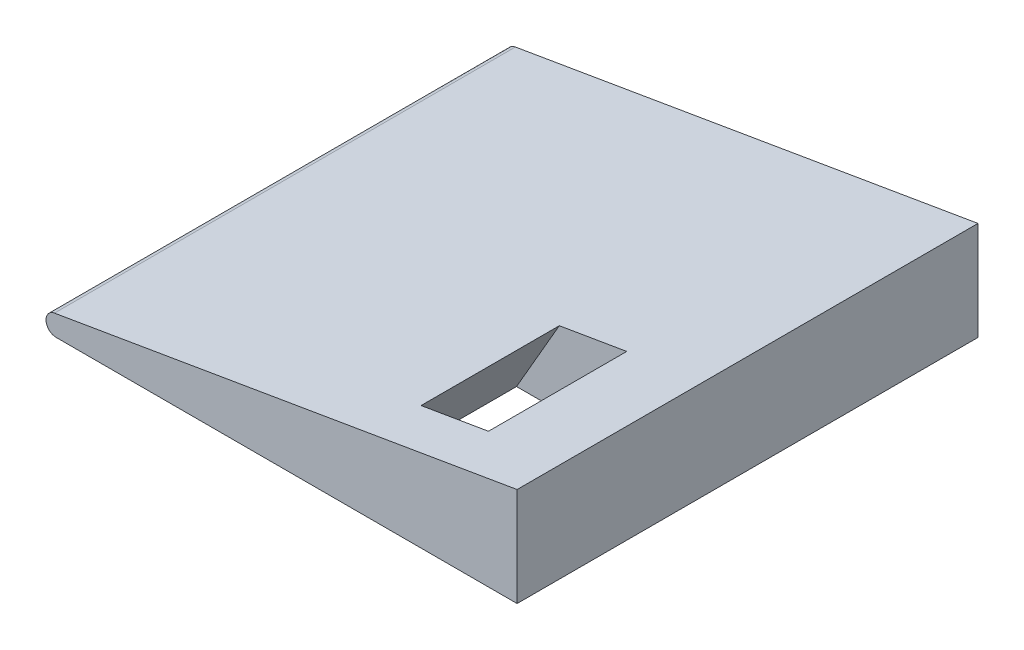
ISO-10303-21;
HEADER;
FILE_DESCRIPTION(('STEP AP214'),'2;1');
FILE_NAME('part.step','',(''),(''),'','','');
FILE_SCHEMA(('AUTOMOTIVE_DESIGN { 1 0 10303 214 1 1 1 1 }'));
ENDSEC;
DATA;
#1=APPLICATION_CONTEXT('core data for automotive mechanical design processes');
#2=APPLICATION_PROTOCOL_DEFINITION('international standard','automotive_design',2000,#1);
#3=PRODUCT_CONTEXT('',#1,'mechanical');
#4=PRODUCT('Part','Part','',(#3));
#5=PRODUCT_RELATED_PRODUCT_CATEGORY('part','',(#4));
#6=PRODUCT_DEFINITION_FORMATION('','',#4);
#7=PRODUCT_DEFINITION_CONTEXT('part definition',#1,'design');
#8=PRODUCT_DEFINITION('design','',#6,#7);
#9=PRODUCT_DEFINITION_SHAPE('','',#8);
#10=(LENGTH_UNIT() NAMED_UNIT(*) SI_UNIT(.MILLI.,.METRE.));
#11=(NAMED_UNIT(*) PLANE_ANGLE_UNIT() SI_UNIT($,.RADIAN.));
#12=(NAMED_UNIT(*) SI_UNIT($,.STERADIAN.) SOLID_ANGLE_UNIT());
#13=UNCERTAINTY_MEASURE_WITH_UNIT(LENGTH_MEASURE(1.E-05),#10,'distance_accuracy_value','');
#14=(GEOMETRIC_REPRESENTATION_CONTEXT(3) GLOBAL_UNCERTAINTY_ASSIGNED_CONTEXT((#13)) GLOBAL_UNIT_ASSIGNED_CONTEXT((#10,
#11,#12)) REPRESENTATION_CONTEXT('',''));
#15=CARTESIAN_POINT('',(0.,0.,0.));
#16=DIRECTION('',(0.,0.,1.));
#17=DIRECTION('',(1.,0.,0.));
#18=AXIS2_PLACEMENT_3D('',#15,#16,#17);
#19=CARTESIAN_POINT('',(0.,76.2,177.8));
#20=DIRECTION('',(-1.,0.,0.));
#21=DIRECTION('',(0.,-1.,0.));
#22=AXIS2_PLACEMENT_3D('',#19,#20,#21);
#23=PLANE('',#22);
#24=DIRECTION('',(0.,1.,0.));
#25=VECTOR('',#24,1.);
#26=CARTESIAN_POINT('',(0.,76.2,-177.8));
#27=LINE('',#26,#25);
#28=CARTESIAN_POINT('',(0.,0.,-177.8));
#29=VERTEX_POINT('',#28);
#30=CARTESIAN_POINT('',(0.,76.2,-177.8));
#31=VERTEX_POINT('',#30);
#32=EDGE_CURVE('E138',#29,#31,#27,.T.);
#33=ORIENTED_EDGE('',*,*,#32,.T.);
#34=DIRECTION('',(0.,0.,-1.));
#35=VECTOR('',#34,1.);
#36=CARTESIAN_POINT('',(0.,76.2,177.8));
#37=LINE('',#36,#35);
#38=CARTESIAN_POINT('',(0.,76.2,177.8));
#39=VERTEX_POINT('',#38);
#40=EDGE_CURVE('E94',#39,#31,#37,.T.);
#41=ORIENTED_EDGE('',*,*,#40,.F.);
#42=DIRECTION('',(0.,1.,0.));
#43=VECTOR('',#42,1.);
#44=CARTESIAN_POINT('',(0.,76.2,177.8));
#45=LINE('',#44,#43);
#46=CARTESIAN_POINT('',(0.,0.,177.8));
#47=VERTEX_POINT('',#46);
#48=EDGE_CURVE('E129',#47,#39,#45,.T.);
#49=ORIENTED_EDGE('',*,*,#48,.F.);
#50=DIRECTION('',(0.,0.,-1.));
#51=VECTOR('',#50,1.);
#52=CARTESIAN_POINT('',(0.,0.,177.8));
#53=LINE('',#52,#51);
#54=EDGE_CURVE('E120',#47,#29,#53,.T.);
#55=ORIENTED_EDGE('',*,*,#54,.T.);
#56=EDGE_LOOP('',(#33,#41,#49,#55));
#57=FACE_BOUND('',#56,.T.);
#58=ADVANCED_FACE('F28',(#57),#23,.F.);
#59=CARTESIAN_POINT('',(-356.915749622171,15.6129272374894,177.8));
#60=DIRECTION('',(0.167357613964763,-0.985896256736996,0.));
#61=DIRECTION('',(0.985896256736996,0.167357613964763,0.));
#62=AXIS2_PLACEMENT_3D('',#59,#60,#61);
#63=PLANE('',#62);
#64=DIRECTION('',(0.985896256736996,0.167357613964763,0.));
#65=VECTOR('',#64,1.);
#66=CARTESIAN_POINT('',(-356.915749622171,15.6129272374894,33.02));
#67=LINE('',#66,#65);
#68=CARTESIAN_POINT('',(-112.204290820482,57.1531253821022,33.02));
#69=VERTEX_POINT('',#68);
#70=CARTESIAN_POINT('',(-60.1784001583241,65.9846113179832,33.02));
#71=VERTEX_POINT('',#70);
#72=EDGE_CURVE('E148',#69,#71,#67,.T.);
#73=ORIENTED_EDGE('',*,*,#72,.T.);
#74=DIRECTION('',(0.,0.,1.));
#75=VECTOR('',#74,1.);
#76=CARTESIAN_POINT('',(-60.178400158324,65.9846113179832,177.8));
#77=LINE('',#76,#75);
#78=CARTESIAN_POINT('',(-60.1784001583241,65.9846113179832,139.7));
#79=VERTEX_POINT('',#78);
#80=EDGE_CURVE('E101',#71,#79,#77,.T.);
#81=ORIENTED_EDGE('',*,*,#80,.T.);
#82=DIRECTION('',(-0.985896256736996,-0.167357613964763,0.));
#83=VECTOR('',#82,1.);
#84=CARTESIAN_POINT('',(-356.915749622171,15.6129272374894,139.7));
#85=LINE('',#84,#83);
#86=CARTESIAN_POINT('',(-112.204290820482,57.1531253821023,139.7));
#87=VERTEX_POINT('',#86);
#88=EDGE_CURVE('E142',#79,#87,#85,.T.);
#89=ORIENTED_EDGE('',*,*,#88,.T.);
#90=DIRECTION('',(0.,0.,-1.));
#91=VECTOR('',#90,1.);
#92=CARTESIAN_POINT('',(-112.204290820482,57.1531253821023,177.8));
#93=LINE('',#92,#91);
#94=EDGE_CURVE('E145',#87,#69,#93,.T.);
#95=ORIENTED_EDGE('',*,*,#94,.T.);
#96=EDGE_LOOP('',(#73,#81,#89,#95));
#97=FACE_BOUND('',#96,.T.);
#98=DIRECTION('',(-0.985896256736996,-0.167357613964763,0.));
#99=VECTOR('',#98,1.);
#100=CARTESIAN_POINT('',(-356.915749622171,15.6129272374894,-177.8));
#101=LINE('',#100,#99);
#102=CARTESIAN_POINT('',(-356.915749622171,15.6129272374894,-177.8));
#103=VERTEX_POINT('',#102);
#104=EDGE_CURVE('E136',#31,#103,#101,.T.);
#105=ORIENTED_EDGE('',*,*,#104,.T.);
#106=DIRECTION('',(0.,0.,-1.));
#107=VECTOR('',#106,1.);
#108=CARTESIAN_POINT('',(-356.915749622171,15.6129272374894,177.8));
#109=LINE('',#108,#107);
#110=CARTESIAN_POINT('',(-356.915749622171,15.6129272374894,177.8));
#111=VERTEX_POINT('',#110);
#112=EDGE_CURVE('E114',#111,#103,#109,.T.);
#113=ORIENTED_EDGE('',*,*,#112,.F.);
#114=DIRECTION('',(-0.985896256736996,-0.167357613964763,0.));
#115=VECTOR('',#114,1.);
#116=CARTESIAN_POINT('',(-356.915749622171,15.6129272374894,177.8));
#117=LINE('',#116,#115);
#118=EDGE_CURVE('E127',#39,#111,#117,.T.);
#119=ORIENTED_EDGE('',*,*,#118,.F.);
#120=ORIENTED_EDGE('',*,*,#40,.T.);
#121=EDGE_LOOP('',(#105,#113,#119,#120));
#122=FACE_BOUND('',#121,.T.);
#123=ADVANCED_FACE('F155',(#97,#122),#63,.F.);
#124=CARTESIAN_POINT('',(-355.6,7.86190476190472,177.8));
#125=DIRECTION('',(0.,0.,-1.));
#126=DIRECTION('',(-1.,0.,0.));
#127=AXIS2_PLACEMENT_3D('',#124,#125,#126);
#128=CYLINDRICAL_SURFACE('',#127,7.86190476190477);
#129=CARTESIAN_POINT('',(-355.6,7.86190476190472,-177.8));
#130=DIRECTION('',(0.,0.,1.));
#131=DIRECTION('',(-1.,0.,0.));
#132=AXIS2_PLACEMENT_3D('',#129,#130,#131);
#133=CIRCLE('',#132,7.86190476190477);
#134=CARTESIAN_POINT('',(-355.6,0.,-177.8));
#135=VERTEX_POINT('',#134);
#136=EDGE_CURVE('E134',#103,#135,#133,.T.);
#137=ORIENTED_EDGE('',*,*,#136,.T.);
#138=DIRECTION('',(0.,0.,-1.));
#139=VECTOR('',#138,1.);
#140=CARTESIAN_POINT('',(-355.6,0.,177.8));
#141=LINE('',#140,#139);
#142=CARTESIAN_POINT('',(-355.6,0.,177.8));
#143=VERTEX_POINT('',#142);
#144=EDGE_CURVE('E117',#143,#135,#141,.T.);
#145=ORIENTED_EDGE('',*,*,#144,.F.);
#146=CARTESIAN_POINT('',(-355.6,7.86190476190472,177.8));
#147=DIRECTION('',(0.,0.,1.));
#148=DIRECTION('',(-1.,0.,0.));
#149=AXIS2_PLACEMENT_3D('',#146,#147,#148);
#150=CIRCLE('',#149,7.86190476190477);
#151=EDGE_CURVE('E125',#111,#143,#150,.T.);
#152=ORIENTED_EDGE('',*,*,#151,.F.);
#153=ORIENTED_EDGE('',*,*,#112,.T.);
#154=EDGE_LOOP('',(#137,#145,#152,#153));
#155=FACE_BOUND('',#154,.T.);
#156=ADVANCED_FACE('F175',(#155),#128,.T.);
#157=CARTESIAN_POINT('',(0.,0.,177.8));
#158=DIRECTION('',(0.,1.,0.));
#159=DIRECTION('',(-1.,0.,0.));
#160=AXIS2_PLACEMENT_3D('',#157,#158,#159);
#161=PLANE('',#160);
#162=DIRECTION('',(1.,0.,0.));
#163=VECTOR('',#162,1.);
#164=CARTESIAN_POINT('',(0.,0.,139.7));
#165=LINE('',#164,#163);
#166=CARTESIAN_POINT('',(-145.201663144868,0.,139.7));
#167=VERTEX_POINT('',#166);
#168=CARTESIAN_POINT('',(-98.2746332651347,0.,139.7));
#169=VERTEX_POINT('',#168);
#170=EDGE_CURVE('E35',#167,#169,#165,.T.);
#171=ORIENTED_EDGE('',*,*,#170,.T.);
#172=DIRECTION('',(0.,0.,-1.));
#173=VECTOR('',#172,1.);
#174=CARTESIAN_POINT('',(-98.2746332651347,0.,177.8));
#175=LINE('',#174,#173);
#176=CARTESIAN_POINT('',(-98.2746332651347,0.,33.02));
#177=VERTEX_POINT('',#176);
#178=EDGE_CURVE('E11',#169,#177,#175,.T.);
#179=ORIENTED_EDGE('',*,*,#178,.T.);
#180=DIRECTION('',(-1.,0.,0.));
#181=VECTOR('',#180,1.);
#182=CARTESIAN_POINT('',(0.,0.,33.02));
#183=LINE('',#182,#181);
#184=CARTESIAN_POINT('',(-145.201663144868,0.,33.02));
#185=VERTEX_POINT('',#184);
#186=EDGE_CURVE('E89',#177,#185,#183,.T.);
#187=ORIENTED_EDGE('',*,*,#186,.T.);
#188=DIRECTION('',(0.,0.,1.));
#189=VECTOR('',#188,1.);
#190=CARTESIAN_POINT('',(-145.201663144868,0.,177.8));
#191=LINE('',#190,#189);
#192=EDGE_CURVE('E93',#185,#167,#191,.T.);
#193=ORIENTED_EDGE('',*,*,#192,.T.);
#194=EDGE_LOOP('',(#171,#179,#187,#193));
#195=FACE_BOUND('',#194,.T.);
#196=DIRECTION('',(1.,0.,0.));
#197=VECTOR('',#196,1.);
#198=CARTESIAN_POINT('',(0.,0.,-177.8));
#199=LINE('',#198,#197);
#200=EDGE_CURVE('E132',#135,#29,#199,.T.);
#201=ORIENTED_EDGE('',*,*,#200,.T.);
#202=ORIENTED_EDGE('',*,*,#54,.F.);
#203=DIRECTION('',(1.,0.,0.));
#204=VECTOR('',#203,1.);
#205=CARTESIAN_POINT('',(0.,0.,177.8));
#206=LINE('',#205,#204);
#207=EDGE_CURVE('E123',#143,#47,#206,.T.);
#208=ORIENTED_EDGE('',*,*,#207,.F.);
#209=ORIENTED_EDGE('',*,*,#144,.T.);
#210=EDGE_LOOP('',(#201,#202,#208,#209));
#211=FACE_BOUND('',#210,.T.);
#212=ADVANCED_FACE('F105',(#195,#211),#161,.F.);
#213=CARTESIAN_POINT('',(-355.6,7.86190476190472,177.8));
#214=DIRECTION('',(0.,0.,-1.));
#215=DIRECTION('',(-1.,0.,0.));
#216=AXIS2_PLACEMENT_3D('',#213,#214,#215);
#217=PLANE('',#216);
#218=ORIENTED_EDGE('',*,*,#48,.T.);
#219=ORIENTED_EDGE('',*,*,#118,.T.);
#220=ORIENTED_EDGE('',*,*,#151,.T.);
#221=ORIENTED_EDGE('',*,*,#207,.T.);
#222=EDGE_LOOP('',(#218,#219,#220,#221));
#223=FACE_BOUND('',#222,.T.);
#224=ADVANCED_FACE('F186',(#223),#217,.F.);
#225=CARTESIAN_POINT('',(-355.6,7.86190476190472,-177.8));
#226=DIRECTION('',(0.,0.,-1.));
#227=DIRECTION('',(-1.,0.,0.));
#228=AXIS2_PLACEMENT_3D('',#225,#226,#227);
#229=PLANE('',#228);
#230=ORIENTED_EDGE('',*,*,#32,.F.);
#231=ORIENTED_EDGE('',*,*,#200,.F.);
#232=ORIENTED_EDGE('',*,*,#136,.F.);
#233=ORIENTED_EDGE('',*,*,#104,.F.);
#234=EDGE_LOOP('',(#230,#231,#232,#233));
#235=FACE_BOUND('',#234,.T.);
#236=ADVANCED_FACE('F167',(#235),#229,.T.);
#237=CARTESIAN_POINT('',(-164.571451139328,-114.829456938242,33.0199999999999));
#238=DIRECTION('',(0.866025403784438,-0.500000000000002,0.));
#239=DIRECTION('',(0.500000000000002,0.866025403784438,0.));
#240=AXIS2_PLACEMENT_3D('',#237,#238,#239);
#241=PLANE('',#240);
#242=DIRECTION('',(0.500000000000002,0.866025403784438,0.));
#243=VECTOR('',#242,1.);
#244=CARTESIAN_POINT('',(-164.571451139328,-114.829456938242,33.0199999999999));
#245=LINE('',#244,#243);
#246=EDGE_CURVE('E42',#177,#71,#245,.T.);
#247=ORIENTED_EDGE('',*,*,#246,.F.);
#248=ORIENTED_EDGE('',*,*,#178,.F.);
#249=DIRECTION('',(0.500000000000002,0.866025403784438,0.));
#250=VECTOR('',#249,1.);
#251=CARTESIAN_POINT('',(-164.571451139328,-114.829456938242,139.7));
#252=LINE('',#251,#250);
#253=EDGE_CURVE('E149',#169,#79,#252,.T.);
#254=ORIENTED_EDGE('',*,*,#253,.T.);
#255=ORIENTED_EDGE('',*,*,#80,.F.);
#256=EDGE_LOOP('',(#247,#248,#254,#255));
#257=FACE_BOUND('',#256,.T.);
#258=ADVANCED_FACE('F97',(#257),#241,.F.);
#259=CARTESIAN_POINT('',(-164.571451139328,-114.829456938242,139.7));
#260=DIRECTION('',(0.,0.,1.));
#261=DIRECTION('',(0.,-1.,0.));
#262=AXIS2_PLACEMENT_3D('',#259,#260,#261);
#263=PLANE('',#262);
#264=ORIENTED_EDGE('',*,*,#253,.F.);
#265=ORIENTED_EDGE('',*,*,#170,.F.);
#266=DIRECTION('',(0.500000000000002,0.866025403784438,0.));
#267=VECTOR('',#266,1.);
#268=CARTESIAN_POINT('',(-199.766723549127,-94.5094569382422,139.7));
#269=LINE('',#268,#267);
#270=EDGE_CURVE('E152',#167,#87,#269,.T.);
#271=ORIENTED_EDGE('',*,*,#270,.T.);
#272=ORIENTED_EDGE('',*,*,#88,.F.);
#273=EDGE_LOOP('',(#264,#265,#271,#272));
#274=FACE_BOUND('',#273,.T.);
#275=ADVANCED_FACE('F159',(#274),#263,.F.);
#276=CARTESIAN_POINT('',(-199.766723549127,-94.5094569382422,33.02));
#277=DIRECTION('',(-0.866025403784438,0.500000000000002,0.));
#278=DIRECTION('',(-0.500000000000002,-0.866025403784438,0.));
#279=AXIS2_PLACEMENT_3D('',#276,#277,#278);
#280=PLANE('',#279);
#281=ORIENTED_EDGE('',*,*,#270,.F.);
#282=ORIENTED_EDGE('',*,*,#192,.F.);
#283=DIRECTION('',(0.500000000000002,0.866025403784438,0.));
#284=VECTOR('',#283,1.);
#285=CARTESIAN_POINT('',(-199.766723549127,-94.5094569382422,33.02));
#286=LINE('',#285,#284);
#287=EDGE_CURVE('E47',#185,#69,#286,.T.);
#288=ORIENTED_EDGE('',*,*,#287,.T.);
#289=ORIENTED_EDGE('',*,*,#94,.F.);
#290=EDGE_LOOP('',(#281,#282,#288,#289));
#291=FACE_BOUND('',#290,.T.);
#292=ADVANCED_FACE('F158',(#291),#280,.F.);
#293=CARTESIAN_POINT('',(-164.571451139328,-114.829456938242,33.0199999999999));
#294=DIRECTION('',(0.,0.,-1.));
#295=DIRECTION('',(0.,1.,0.));
#296=AXIS2_PLACEMENT_3D('',#293,#294,#295);
#297=PLANE('',#296);
#298=ORIENTED_EDGE('',*,*,#287,.F.);
#299=ORIENTED_EDGE('',*,*,#186,.F.);
#300=ORIENTED_EDGE('',*,*,#246,.T.);
#301=ORIENTED_EDGE('',*,*,#72,.F.);
#302=EDGE_LOOP('',(#298,#299,#300,#301));
#303=FACE_BOUND('',#302,.T.);
#304=ADVANCED_FACE('F90',(#303),#297,.F.);
#305=CLOSED_SHELL('',(#58,#123,#156,#212,#224,#236,#258,#275,#292,#304));
#306=MANIFOLD_SOLID_BREP('B2',#305);
#307=ADVANCED_BREP_SHAPE_REPRESENTATION('',(#18,#306),#14);
#308=SHAPE_DEFINITION_REPRESENTATION(#9,#307);
ENDSEC;
END-ISO-10303-21;
